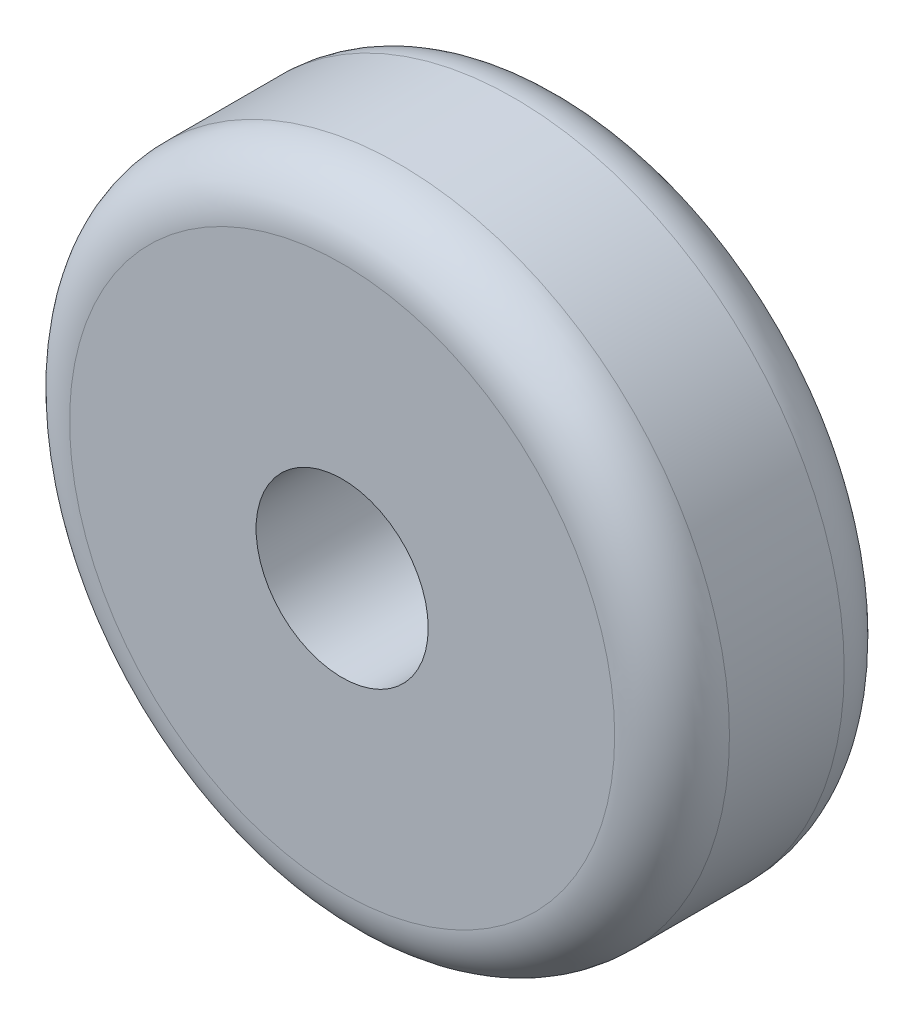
ISO-10303-21;
HEADER;
FILE_DESCRIPTION(('STEP AP214'),'2;1');
FILE_NAME('part.step','',(''),(''),'','','');
FILE_SCHEMA(('AUTOMOTIVE_DESIGN { 1 0 10303 214 1 1 1 1 }'));
ENDSEC;
DATA;
#1=APPLICATION_CONTEXT('core data for automotive mechanical design processes');
#2=APPLICATION_PROTOCOL_DEFINITION('international standard','automotive_design',2000,#1);
#3=PRODUCT_CONTEXT('',#1,'mechanical');
#4=PRODUCT('Part','Part','',(#3));
#5=PRODUCT_RELATED_PRODUCT_CATEGORY('part','',(#4));
#6=PRODUCT_DEFINITION_FORMATION('','',#4);
#7=PRODUCT_DEFINITION_CONTEXT('part definition',#1,'design');
#8=PRODUCT_DEFINITION('design','',#6,#7);
#9=PRODUCT_DEFINITION_SHAPE('','',#8);
#10=(LENGTH_UNIT() NAMED_UNIT(*) SI_UNIT(.MILLI.,.METRE.));
#11=(NAMED_UNIT(*) PLANE_ANGLE_UNIT() SI_UNIT($,.RADIAN.));
#12=(NAMED_UNIT(*) SI_UNIT($,.STERADIAN.) SOLID_ANGLE_UNIT());
#13=UNCERTAINTY_MEASURE_WITH_UNIT(LENGTH_MEASURE(1.E-05),#10,'distance_accuracy_value','');
#14=(GEOMETRIC_REPRESENTATION_CONTEXT(3) GLOBAL_UNCERTAINTY_ASSIGNED_CONTEXT((#13)) GLOBAL_UNIT_ASSIGNED_CONTEXT((#10,
#11,#12)) REPRESENTATION_CONTEXT('',''));
#15=CARTESIAN_POINT('',(0.,0.,0.));
#16=DIRECTION('',(0.,0.,1.));
#17=DIRECTION('',(1.,0.,0.));
#18=AXIS2_PLACEMENT_3D('',#15,#16,#17);
#19=CARTESIAN_POINT('',(0.,0.,4.));
#20=DIRECTION('',(0.,0.,1.));
#21=DIRECTION('',(1.,0.,0.));
#22=AXIS2_PLACEMENT_3D('',#19,#20,#21);
#23=PLANE('',#22);
#24=CARTESIAN_POINT('',(0.,0.,4.));
#25=DIRECTION('',(0.,0.,1.));
#26=DIRECTION('',(1.,0.,0.));
#27=AXIS2_PLACEMENT_3D('',#24,#25,#26);
#28=CIRCLE('',#27,4.75);
#29=CARTESIAN_POINT('',(4.75,0.,4.));
#30=VERTEX_POINT('',#29);
#31=EDGE_CURVE('E46',#30,#30,#28,.T.);
#32=ORIENTED_EDGE('',*,*,#31,.T.);
#33=EDGE_LOOP('',(#32));
#34=FACE_BOUND('',#33,.T.);
#35=CARTESIAN_POINT('',(0.,0.,4.));
#36=DIRECTION('',(0.,0.,1.));
#37=DIRECTION('',(1.,0.,0.));
#38=AXIS2_PLACEMENT_3D('',#35,#36,#37);
#39=CIRCLE('',#38,1.5);
#40=CARTESIAN_POINT('',(1.5,0.,4.));
#41=VERTEX_POINT('',#40);
#42=EDGE_CURVE('E51',#41,#41,#39,.T.);
#43=ORIENTED_EDGE('',*,*,#42,.F.);
#44=EDGE_LOOP('',(#43));
#45=FACE_BOUND('',#44,.T.);
#46=ADVANCED_FACE('F31',(#34,#45),#23,.T.);
#47=CARTESIAN_POINT('',(0.,0.,0.));
#48=DIRECTION('',(0.,0.,1.));
#49=DIRECTION('',(1.,0.,0.));
#50=AXIS2_PLACEMENT_3D('',#47,#48,#49);
#51=PLANE('',#50);
#52=CARTESIAN_POINT('',(0.,0.,0.));
#53=DIRECTION('',(0.,0.,1.));
#54=DIRECTION('',(1.,0.,0.));
#55=AXIS2_PLACEMENT_3D('',#52,#53,#54);
#56=CIRCLE('',#55,4.75);
#57=CARTESIAN_POINT('',(4.75,0.,0.));
#58=VERTEX_POINT('',#57);
#59=EDGE_CURVE('E10',#58,#58,#56,.F.);
#60=ORIENTED_EDGE('',*,*,#59,.T.);
#61=EDGE_LOOP('',(#60));
#62=FACE_BOUND('',#61,.T.);
#63=CARTESIAN_POINT('',(0.,0.,0.));
#64=DIRECTION('',(0.,0.,1.));
#65=DIRECTION('',(1.,0.,0.));
#66=AXIS2_PLACEMENT_3D('',#63,#64,#65);
#67=CIRCLE('',#66,1.5);
#68=CARTESIAN_POINT('',(1.5,0.,0.));
#69=VERTEX_POINT('',#68);
#70=EDGE_CURVE('E52',#69,#69,#67,.T.);
#71=ORIENTED_EDGE('',*,*,#70,.T.);
#72=EDGE_LOOP('',(#71));
#73=FACE_BOUND('',#72,.T.);
#74=ADVANCED_FACE('F62',(#62,#73),#51,.F.);
#75=CARTESIAN_POINT('',(0.,0.,4.));
#76=DIRECTION('',(0.,0.,-1.));
#77=DIRECTION('',(-1.,0.,0.));
#78=AXIS2_PLACEMENT_3D('',#75,#76,#77);
#79=CYLINDRICAL_SURFACE('',#78,5.75);
#80=CARTESIAN_POINT('',(0.,0.,3.));
#81=DIRECTION('',(0.,0.,1.));
#82=DIRECTION('',(1.,0.,0.));
#83=AXIS2_PLACEMENT_3D('',#80,#81,#82);
#84=CIRCLE('',#83,5.75);
#85=CARTESIAN_POINT('',(5.75,0.,3.));
#86=VERTEX_POINT('',#85);
#87=EDGE_CURVE('E38',#86,#86,#84,.F.);
#88=ORIENTED_EDGE('',*,*,#87,.T.);
#89=EDGE_LOOP('',(#88));
#90=FACE_BOUND('',#89,.T.);
#91=CARTESIAN_POINT('',(0.,0.,1.));
#92=DIRECTION('',(0.,0.,1.));
#93=DIRECTION('',(1.,0.,0.));
#94=AXIS2_PLACEMENT_3D('',#91,#92,#93);
#95=CIRCLE('',#94,5.75);
#96=CARTESIAN_POINT('',(5.75,0.,1.));
#97=VERTEX_POINT('',#96);
#98=EDGE_CURVE('E42',#97,#97,#95,.T.);
#99=ORIENTED_EDGE('',*,*,#98,.T.);
#100=EDGE_LOOP('',(#99));
#101=FACE_BOUND('',#100,.T.);
#102=ADVANCED_FACE('F68',(#90,#101),#79,.T.);
#103=CARTESIAN_POINT('',(0.,0.,4.));
#104=DIRECTION('',(0.,0.,-1.));
#105=DIRECTION('',(-1.,0.,0.));
#106=AXIS2_PLACEMENT_3D('',#103,#104,#105);
#107=CYLINDRICAL_SURFACE('',#106,1.5);
#108=ORIENTED_EDGE('',*,*,#42,.T.);
#109=EDGE_LOOP('',(#108));
#110=FACE_BOUND('',#109,.T.);
#111=ORIENTED_EDGE('',*,*,#70,.F.);
#112=EDGE_LOOP('',(#111));
#113=FACE_BOUND('',#112,.T.);
#114=ADVANCED_FACE('F58',(#110,#113),#107,.F.);
#115=CARTESIAN_POINT('',(0.,0.,3.));
#116=DIRECTION('',(0.,0.,1.));
#117=DIRECTION('',(1.,0.,0.));
#118=AXIS2_PLACEMENT_3D('',#115,#116,#117);
#119=TOROIDAL_SURFACE('',#118,4.75,1.);
#120=ORIENTED_EDGE('',*,*,#87,.F.);
#121=EDGE_LOOP('',(#120));
#122=FACE_BOUND('',#121,.T.);
#123=ORIENTED_EDGE('',*,*,#31,.F.);
#124=EDGE_LOOP('',(#123));
#125=FACE_BOUND('',#124,.T.);
#126=ADVANCED_FACE('F73',(#122,#125),#119,.T.);
#127=CARTESIAN_POINT('',(0.,0.,1.));
#128=DIRECTION('',(0.,0.,1.));
#129=DIRECTION('',(1.,0.,0.));
#130=AXIS2_PLACEMENT_3D('',#127,#128,#129);
#131=TOROIDAL_SURFACE('',#130,4.75,1.);
#132=ORIENTED_EDGE('',*,*,#59,.F.);
#133=EDGE_LOOP('',(#132));
#134=FACE_BOUND('',#133,.T.);
#135=ORIENTED_EDGE('',*,*,#98,.F.);
#136=EDGE_LOOP('',(#135));
#137=FACE_BOUND('',#136,.T.);
#138=ADVANCED_FACE('F33',(#134,#137),#131,.T.);
#139=CLOSED_SHELL('',(#46,#74,#102,#114,#126,#138));
#140=MANIFOLD_SOLID_BREP('B2',#139);
#141=ADVANCED_BREP_SHAPE_REPRESENTATION('',(#18,#140),#14);
#142=SHAPE_DEFINITION_REPRESENTATION(#9,#141);
ENDSEC;
END-ISO-10303-21;
